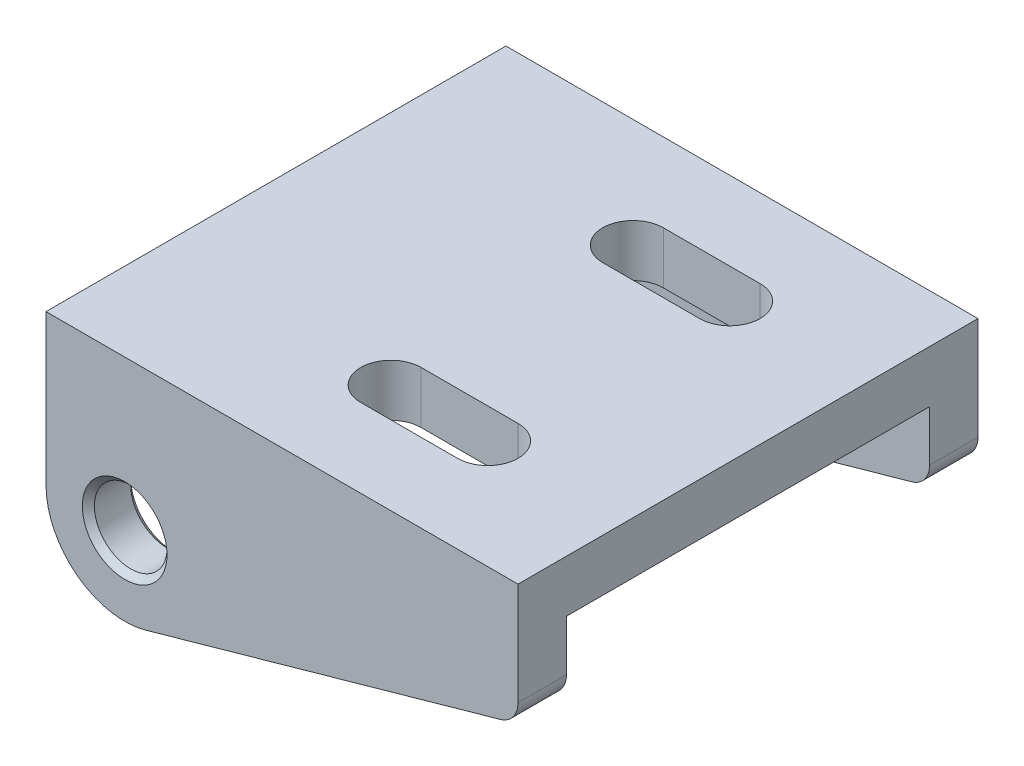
ISO-10303-21;
HEADER;
FILE_DESCRIPTION(('STEP AP214'),'2;1');
FILE_NAME('part.step','',(''),(''),'','','');
FILE_SCHEMA(('AUTOMOTIVE_DESIGN { 1 0 10303 214 1 1 1 1 }'));
ENDSEC;
DATA;
#1=APPLICATION_CONTEXT('core data for automotive mechanical design processes');
#2=APPLICATION_PROTOCOL_DEFINITION('international standard','automotive_design',2000,#1);
#3=PRODUCT_CONTEXT('',#1,'mechanical');
#4=PRODUCT('Part','Part','',(#3));
#5=PRODUCT_RELATED_PRODUCT_CATEGORY('part','',(#4));
#6=PRODUCT_DEFINITION_FORMATION('','',#4);
#7=PRODUCT_DEFINITION_CONTEXT('part definition',#1,'design');
#8=PRODUCT_DEFINITION('design','',#6,#7);
#9=PRODUCT_DEFINITION_SHAPE('','',#8);
#10=(LENGTH_UNIT() NAMED_UNIT(*) SI_UNIT(.MILLI.,.METRE.));
#11=(NAMED_UNIT(*) PLANE_ANGLE_UNIT() SI_UNIT($,.RADIAN.));
#12=(NAMED_UNIT(*) SI_UNIT($,.STERADIAN.) SOLID_ANGLE_UNIT());
#13=UNCERTAINTY_MEASURE_WITH_UNIT(LENGTH_MEASURE(1.E-05),#10,'distance_accuracy_value','');
#14=(GEOMETRIC_REPRESENTATION_CONTEXT(3) GLOBAL_UNCERTAINTY_ASSIGNED_CONTEXT((#13)) GLOBAL_UNIT_ASSIGNED_CONTEXT((#10,
#11,#12)) REPRESENTATION_CONTEXT('',''));
#15=CARTESIAN_POINT('',(0.,0.,0.));
#16=DIRECTION('',(0.,0.,1.));
#17=DIRECTION('',(1.,0.,0.));
#18=AXIS2_PLACEMENT_3D('',#15,#16,#17);
#19=CARTESIAN_POINT('',(0.,-21.,-19.));
#20=DIRECTION('',(0.271460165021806,-0.962449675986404,0.));
#21=DIRECTION('',(0.962449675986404,0.271460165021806,0.));
#22=AXIS2_PLACEMENT_3D('',#19,#20,#21);
#23=PLANE('',#22);
#24=DIRECTION('',(0.962449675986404,0.271460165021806,0.));
#25=VECTOR('',#24,1.);
#26=CARTESIAN_POINT('',(40.490146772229,-9.57970219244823,15.));
#27=LINE('',#26,#25);
#28=CARTESIAN_POINT('',(8.26449107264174,-18.66898969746,15.));
#29=VERTEX_POINT('',#28);
#30=CARTESIAN_POINT('',(37.5429203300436,-10.4109711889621,15.));
#31=VERTEX_POINT('',#30);
#32=EDGE_CURVE('E250',#29,#31,#27,.T.);
#33=ORIENTED_EDGE('',*,*,#32,.T.);
#34=DIRECTION('',(0.,0.,1.));
#35=VECTOR('',#34,1.);
#36=CARTESIAN_POINT('',(37.5429203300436,-10.4109711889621,-19.));
#37=LINE('',#36,#35);
#38=CARTESIAN_POINT('',(37.5429203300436,-10.4109711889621,19.));
#39=VERTEX_POINT('',#38);
#40=EDGE_CURVE('E313',#31,#39,#37,.T.);
#41=ORIENTED_EDGE('',*,*,#40,.T.);
#42=DIRECTION('',(0.962449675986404,0.271460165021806,0.));
#43=VECTOR('',#42,1.);
#44=CARTESIAN_POINT('',(0.,-21.,19.));
#45=LINE('',#44,#43);
#46=CARTESIAN_POINT('',(8.26449107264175,-18.66898969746,19.));
#47=VERTEX_POINT('',#46);
#48=EDGE_CURVE('E277',#47,#39,#45,.T.);
#49=ORIENTED_EDGE('',*,*,#48,.F.);
#50=DIRECTION('',(0.,0.,1.));
#51=VECTOR('',#50,1.);
#52=CARTESIAN_POINT('',(8.26449107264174,-18.66898969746,-19.));
#53=LINE('',#52,#51);
#54=EDGE_CURVE('E308',#47,#29,#53,.F.);
#55=ORIENTED_EDGE('',*,*,#54,.T.);
#56=EDGE_LOOP('',(#33,#41,#49,#55));
#57=FACE_BOUND('',#56,.T.);
#58=ADVANCED_FACE('F34',(#57),#23,.T.);
#59=CARTESIAN_POINT('',(6.5,-12.4130668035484,-19.));
#60=DIRECTION('',(0.,0.,1.));
#61=DIRECTION('',(1.,0.,0.));
#62=AXIS2_PLACEMENT_3D('',#59,#60,#61);
#63=CYLINDRICAL_SURFACE('',#62,6.5);
#64=CARTESIAN_POINT('',(6.5,-12.4130668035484,15.));
#65=DIRECTION('',(0.,0.,1.));
#66=DIRECTION('',(0.,-1.,0.));
#67=AXIS2_PLACEMENT_3D('',#64,#65,#66);
#68=CIRCLE('',#67,6.5);
#69=CARTESIAN_POINT('',(0.,-12.4130668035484,15.));
#70=VERTEX_POINT('',#69);
#71=EDGE_CURVE('E238',#70,#29,#68,.T.);
#72=ORIENTED_EDGE('',*,*,#71,.T.);
#73=ORIENTED_EDGE('',*,*,#54,.F.);
#74=CARTESIAN_POINT('',(6.5,-12.4130668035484,19.));
#75=DIRECTION('',(0.,0.,1.));
#76=DIRECTION('',(1.,0.,0.));
#77=AXIS2_PLACEMENT_3D('',#74,#75,#76);
#78=CIRCLE('',#77,6.5);
#79=CARTESIAN_POINT('',(0.,-12.4130668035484,19.));
#80=VERTEX_POINT('',#79);
#81=EDGE_CURVE('E305',#80,#47,#78,.T.);
#82=ORIENTED_EDGE('',*,*,#81,.F.);
#83=DIRECTION('',(0.,0.,1.));
#84=VECTOR('',#83,1.);
#85=CARTESIAN_POINT('',(0.,-12.4130668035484,-19.));
#86=LINE('',#85,#84);
#87=EDGE_CURVE('E299',#70,#80,#86,.T.);
#88=ORIENTED_EDGE('',*,*,#87,.F.);
#89=EDGE_LOOP('',(#72,#73,#82,#88));
#90=FACE_BOUND('',#89,.T.);
#91=ADVANCED_FACE('F398',(#90),#63,.T.);
#92=CARTESIAN_POINT('',(37.,-8.48607183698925,-19.));
#93=DIRECTION('',(0.,0.,1.));
#94=DIRECTION('',(1.,0.,0.));
#95=AXIS2_PLACEMENT_3D('',#92,#93,#94);
#96=CYLINDRICAL_SURFACE('',#95,2.);
#97=CARTESIAN_POINT('',(37.,-8.48607183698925,15.));
#98=DIRECTION('',(0.,0.,1.));
#99=DIRECTION('',(0.,-1.,0.));
#100=AXIS2_PLACEMENT_3D('',#97,#98,#99);
#101=CIRCLE('',#100,2.);
#102=CARTESIAN_POINT('',(39.,-8.48607183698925,15.));
#103=VERTEX_POINT('',#102);
#104=EDGE_CURVE('E247',#31,#103,#101,.T.);
#105=ORIENTED_EDGE('',*,*,#104,.T.);
#106=DIRECTION('',(0.,0.,1.));
#107=VECTOR('',#106,1.);
#108=CARTESIAN_POINT('',(39.,-8.48607183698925,-19.));
#109=LINE('',#108,#107);
#110=CARTESIAN_POINT('',(39.,-8.48607183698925,19.));
#111=VERTEX_POINT('',#110);
#112=EDGE_CURVE('E320',#111,#103,#109,.F.);
#113=ORIENTED_EDGE('',*,*,#112,.F.);
#114=CARTESIAN_POINT('',(37.,-8.48607183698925,19.));
#115=DIRECTION('',(0.,0.,1.));
#116=DIRECTION('',(1.,0.,0.));
#117=AXIS2_PLACEMENT_3D('',#114,#115,#116);
#118=CIRCLE('',#117,2.);
#119=EDGE_CURVE('E317',#39,#111,#118,.T.);
#120=ORIENTED_EDGE('',*,*,#119,.F.);
#121=ORIENTED_EDGE('',*,*,#40,.F.);
#122=EDGE_LOOP('',(#105,#113,#120,#121));
#123=FACE_BOUND('',#122,.T.);
#124=ADVANCED_FACE('F406',(#123),#96,.T.);
#125=CARTESIAN_POINT('',(0.,0.,-19.));
#126=DIRECTION('',(-1.,0.,0.));
#127=DIRECTION('',(0.,-1.,0.));
#128=AXIS2_PLACEMENT_3D('',#125,#126,#127);
#129=PLANE('',#128);
#130=DIRECTION('',(0.,1.,0.));
#131=VECTOR('',#130,1.);
#132=CARTESIAN_POINT('',(0.,-4.3,15.));
#133=LINE('',#132,#131);
#134=CARTESIAN_POINT('',(0.,-4.3,15.));
#135=VERTEX_POINT('',#134);
#136=EDGE_CURVE('E253',#70,#135,#133,.T.);
#137=ORIENTED_EDGE('',*,*,#136,.F.);
#138=ORIENTED_EDGE('',*,*,#87,.T.);
#139=DIRECTION('',(0.,-1.,0.));
#140=VECTOR('',#139,1.);
#141=CARTESIAN_POINT('',(0.,0.,19.));
#142=LINE('',#141,#140);
#143=CARTESIAN_POINT('',(0.,0.,19.));
#144=VERTEX_POINT('',#143);
#145=EDGE_CURVE('E274',#144,#80,#142,.T.);
#146=ORIENTED_EDGE('',*,*,#145,.F.);
#147=DIRECTION('',(0.,0.,1.));
#148=VECTOR('',#147,1.);
#149=CARTESIAN_POINT('',(0.,0.,-19.));
#150=LINE('',#149,#148);
#151=CARTESIAN_POINT('',(0.,0.,-19.));
#152=VERTEX_POINT('',#151);
#153=EDGE_CURVE('E297',#152,#144,#150,.T.);
#154=ORIENTED_EDGE('',*,*,#153,.F.);
#155=DIRECTION('',(0.,-1.,0.));
#156=VECTOR('',#155,1.);
#157=CARTESIAN_POINT('',(0.,0.,-19.));
#158=LINE('',#157,#156);
#159=CARTESIAN_POINT('',(0.,-12.4130668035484,-19.));
#160=VERTEX_POINT('',#159);
#161=EDGE_CURVE('E285',#152,#160,#158,.T.);
#162=ORIENTED_EDGE('',*,*,#161,.T.);
#163=CARTESIAN_POINT('',(0.,-12.4130668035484,-15.));
#164=VERTEX_POINT('',#163);
#165=EDGE_CURVE('E302',#160,#164,#86,.T.);
#166=ORIENTED_EDGE('',*,*,#165,.T.);
#167=DIRECTION('',(0.,-1.,0.));
#168=VECTOR('',#167,1.);
#169=CARTESIAN_POINT('',(0.,-4.3,-15.));
#170=LINE('',#169,#168);
#171=CARTESIAN_POINT('',(0.,-4.3,-15.));
#172=VERTEX_POINT('',#171);
#173=EDGE_CURVE('E259',#172,#164,#170,.T.);
#174=ORIENTED_EDGE('',*,*,#173,.F.);
#175=DIRECTION('',(0.,0.,-1.));
#176=VECTOR('',#175,1.);
#177=CARTESIAN_POINT('',(0.,-4.3,-15.));
#178=LINE('',#177,#176);
#179=EDGE_CURVE('E256',#135,#172,#178,.T.);
#180=ORIENTED_EDGE('',*,*,#179,.F.);
#181=EDGE_LOOP('',(#137,#138,#146,#154,#162,#166,#174,#180));
#182=FACE_BOUND('',#181,.T.);
#183=ADVANCED_FACE('F379',(#182),#129,.T.);
#184=CARTESIAN_POINT('',(0.,0.,-19.));
#185=DIRECTION('',(0.,1.,0.));
#186=DIRECTION('',(0.,0.,1.));
#187=AXIS2_PLACEMENT_3D('',#184,#185,#186);
#188=PLANE('',#187);
#189=CARTESIAN_POINT('',(19.5,0.,-10.));
#190=DIRECTION('',(0.,1.,0.));
#191=DIRECTION('',(0.,0.,1.));
#192=AXIS2_PLACEMENT_3D('',#189,#190,#191);
#193=CIRCLE('',#192,2.5);
#194=CARTESIAN_POINT('',(19.5,0.,-12.5));
#195=VERTEX_POINT('',#194);
#196=CARTESIAN_POINT('',(19.5,0.,-7.5));
#197=VERTEX_POINT('',#196);
#198=EDGE_CURVE('E204',#195,#197,#193,.T.);
#199=ORIENTED_EDGE('',*,*,#198,.F.);
#200=DIRECTION('',(-1.,0.,0.));
#201=VECTOR('',#200,1.);
#202=CARTESIAN_POINT('',(0.,0.,-12.5));
#203=LINE('',#202,#201);
#204=CARTESIAN_POINT('',(27.5,0.,-12.5));
#205=VERTEX_POINT('',#204);
#206=EDGE_CURVE('E197',#205,#195,#203,.T.);
#207=ORIENTED_EDGE('',*,*,#206,.F.);
#208=CARTESIAN_POINT('',(27.5,0.,-10.));
#209=DIRECTION('',(0.,1.,0.));
#210=DIRECTION('',(0.,0.,1.));
#211=AXIS2_PLACEMENT_3D('',#208,#209,#210);
#212=CIRCLE('',#211,2.5);
#213=CARTESIAN_POINT('',(27.5,0.,-7.5));
#214=VERTEX_POINT('',#213);
#215=EDGE_CURVE('E177',#214,#205,#212,.T.);
#216=ORIENTED_EDGE('',*,*,#215,.F.);
#217=DIRECTION('',(1.,0.,0.));
#218=VECTOR('',#217,1.);
#219=CARTESIAN_POINT('',(0.,0.,-7.5));
#220=LINE('',#219,#218);
#221=EDGE_CURVE('E202',#197,#214,#220,.T.);
#222=ORIENTED_EDGE('',*,*,#221,.F.);
#223=EDGE_LOOP('',(#199,#207,#216,#222));
#224=FACE_BOUND('',#223,.T.);
#225=CARTESIAN_POINT('',(19.5,0.,10.));
#226=DIRECTION('',(0.,1.,0.));
#227=DIRECTION('',(0.,0.,1.));
#228=AXIS2_PLACEMENT_3D('',#225,#226,#227);
#229=CIRCLE('',#228,2.5);
#230=CARTESIAN_POINT('',(19.5,0.,7.5));
#231=VERTEX_POINT('',#230);
#232=CARTESIAN_POINT('',(19.5,0.,12.5));
#233=VERTEX_POINT('',#232);
#234=EDGE_CURVE('E233',#231,#233,#229,.T.);
#235=ORIENTED_EDGE('',*,*,#234,.F.);
#236=DIRECTION('',(-1.,0.,0.));
#237=VECTOR('',#236,1.);
#238=CARTESIAN_POINT('',(0.,0.,7.5));
#239=LINE('',#238,#237);
#240=CARTESIAN_POINT('',(27.5,0.,7.50000000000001));
#241=VERTEX_POINT('',#240);
#242=EDGE_CURVE('E220',#241,#231,#239,.T.);
#243=ORIENTED_EDGE('',*,*,#242,.F.);
#244=CARTESIAN_POINT('',(27.5,0.,10.));
#245=DIRECTION('',(0.,1.,0.));
#246=DIRECTION('',(0.,0.,1.));
#247=AXIS2_PLACEMENT_3D('',#244,#245,#246);
#248=CIRCLE('',#247,2.5);
#249=CARTESIAN_POINT('',(27.5,0.,12.5));
#250=VERTEX_POINT('',#249);
#251=EDGE_CURVE('E228',#250,#241,#248,.T.);
#252=ORIENTED_EDGE('',*,*,#251,.F.);
#253=DIRECTION('',(1.,0.,0.));
#254=VECTOR('',#253,1.);
#255=CARTESIAN_POINT('',(0.,0.,12.5));
#256=LINE('',#255,#254);
#257=EDGE_CURVE('E231',#233,#250,#256,.T.);
#258=ORIENTED_EDGE('',*,*,#257,.F.);
#259=EDGE_LOOP('',(#235,#243,#252,#258));
#260=FACE_BOUND('',#259,.T.);
#261=ORIENTED_EDGE('',*,*,#153,.T.);
#262=DIRECTION('',(-1.,0.,0.));
#263=VECTOR('',#262,1.);
#264=CARTESIAN_POINT('',(0.,0.,19.));
#265=LINE('',#264,#263);
#266=CARTESIAN_POINT('',(39.,0.,19.));
#267=VERTEX_POINT('',#266);
#268=EDGE_CURVE('E282',#267,#144,#265,.T.);
#269=ORIENTED_EDGE('',*,*,#268,.F.);
#270=DIRECTION('',(0.,0.,1.));
#271=VECTOR('',#270,1.);
#272=CARTESIAN_POINT('',(39.,0.,-19.));
#273=LINE('',#272,#271);
#274=CARTESIAN_POINT('',(39.,0.,-19.));
#275=VERTEX_POINT('',#274);
#276=EDGE_CURVE('E296',#275,#267,#273,.T.);
#277=ORIENTED_EDGE('',*,*,#276,.F.);
#278=DIRECTION('',(-1.,0.,0.));
#279=VECTOR('',#278,1.);
#280=CARTESIAN_POINT('',(0.,0.,-19.));
#281=LINE('',#280,#279);
#282=EDGE_CURVE('E293',#275,#152,#281,.T.);
#283=ORIENTED_EDGE('',*,*,#282,.T.);
#284=EDGE_LOOP('',(#261,#269,#277,#283));
#285=FACE_BOUND('',#284,.T.);
#286=ADVANCED_FACE('F385',(#224,#260,#285),#188,.T.);
#287=CARTESIAN_POINT('',(39.,0.,-19.));
#288=DIRECTION('',(1.,0.,0.));
#289=DIRECTION('',(0.,0.,-1.));
#290=AXIS2_PLACEMENT_3D('',#287,#288,#289);
#291=PLANE('',#290);
#292=DIRECTION('',(0.,1.,0.));
#293=VECTOR('',#292,1.);
#294=CARTESIAN_POINT('',(39.,-4.29999999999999,15.));
#295=LINE('',#294,#293);
#296=CARTESIAN_POINT('',(39.,-4.29999999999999,15.));
#297=VERTEX_POINT('',#296);
#298=EDGE_CURVE('E244',#103,#297,#295,.T.);
#299=ORIENTED_EDGE('',*,*,#298,.T.);
#300=DIRECTION('',(0.,0.,-1.));
#301=VECTOR('',#300,1.);
#302=CARTESIAN_POINT('',(39.,-4.29999999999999,-15.));
#303=LINE('',#302,#301);
#304=CARTESIAN_POINT('',(39.,-4.29999999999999,-15.));
#305=VERTEX_POINT('',#304);
#306=EDGE_CURVE('E264',#297,#305,#303,.T.);
#307=ORIENTED_EDGE('',*,*,#306,.T.);
#308=DIRECTION('',(0.,-1.,0.));
#309=VECTOR('',#308,1.);
#310=CARTESIAN_POINT('',(39.,-4.29999999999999,-15.));
#311=LINE('',#310,#309);
#312=CARTESIAN_POINT('',(39.,-8.48607183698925,-15.));
#313=VERTEX_POINT('',#312);
#314=EDGE_CURVE('E241',#305,#313,#311,.T.);
#315=ORIENTED_EDGE('',*,*,#314,.T.);
#316=CARTESIAN_POINT('',(39.,-8.48607183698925,-19.));
#317=VERTEX_POINT('',#316);
#318=EDGE_CURVE('E319',#313,#317,#109,.F.);
#319=ORIENTED_EDGE('',*,*,#318,.T.);
#320=DIRECTION('',(0.,1.,0.));
#321=VECTOR('',#320,1.);
#322=CARTESIAN_POINT('',(39.,0.,-19.));
#323=LINE('',#322,#321);
#324=EDGE_CURVE('E291',#317,#275,#323,.T.);
#325=ORIENTED_EDGE('',*,*,#324,.T.);
#326=ORIENTED_EDGE('',*,*,#276,.T.);
#327=DIRECTION('',(0.,1.,0.));
#328=VECTOR('',#327,1.);
#329=CARTESIAN_POINT('',(39.,0.,19.));
#330=LINE('',#329,#328);
#331=EDGE_CURVE('E280',#111,#267,#330,.T.);
#332=ORIENTED_EDGE('',*,*,#331,.F.);
#333=ORIENTED_EDGE('',*,*,#112,.T.);
#334=EDGE_LOOP('',(#299,#307,#315,#319,#325,#326,#332,#333));
#335=FACE_BOUND('',#334,.T.);
#336=ADVANCED_FACE('F389',(#335),#291,.T.);
#337=DIRECTION('',(-0.962449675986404,-0.271460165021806,0.));
#338=VECTOR('',#337,1.);
#339=CARTESIAN_POINT('',(40.490146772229,-9.57970219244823,-15.));
#340=LINE('',#339,#338);
#341=CARTESIAN_POINT('',(37.5429203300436,-10.4109711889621,-15.));
#342=VERTEX_POINT('',#341);
#343=CARTESIAN_POINT('',(8.26449107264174,-18.66898969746,-15.));
#344=VERTEX_POINT('',#343);
#345=EDGE_CURVE('E271',#342,#344,#340,.T.);
#346=ORIENTED_EDGE('',*,*,#345,.T.);
#347=CARTESIAN_POINT('',(8.26449107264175,-18.66898969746,-19.));
#348=VERTEX_POINT('',#347);
#349=EDGE_CURVE('E307',#344,#348,#53,.F.);
#350=ORIENTED_EDGE('',*,*,#349,.T.);
#351=DIRECTION('',(0.962449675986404,0.271460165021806,0.));
#352=VECTOR('',#351,1.);
#353=CARTESIAN_POINT('',(0.,-21.,-19.));
#354=LINE('',#353,#352);
#355=CARTESIAN_POINT('',(37.5429203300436,-10.4109711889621,-19.));
#356=VERTEX_POINT('',#355);
#357=EDGE_CURVE('E288',#348,#356,#354,.T.);
#358=ORIENTED_EDGE('',*,*,#357,.T.);
#359=EDGE_CURVE('E314',#356,#342,#37,.T.);
#360=ORIENTED_EDGE('',*,*,#359,.T.);
#361=EDGE_LOOP('',(#346,#350,#358,#360));
#362=FACE_BOUND('',#361,.T.);
#363=ADVANCED_FACE('F366',(#362),#23,.T.);
#364=CARTESIAN_POINT('',(0.,0.,-19.));
#365=DIRECTION('',(0.,0.,1.));
#366=DIRECTION('',(1.,0.,0.));
#367=AXIS2_PLACEMENT_3D('',#364,#365,#366);
#368=PLANE('',#367);
#369=CARTESIAN_POINT('',(6.5,-12.4130668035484,-19.));
#370=DIRECTION('',(0.,0.,1.));
#371=DIRECTION('',(1.,0.,0.));
#372=AXIS2_PLACEMENT_3D('',#369,#370,#371);
#373=CIRCLE('',#372,3.50000000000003);
#374=CARTESIAN_POINT('',(10.,-12.4130668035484,-19.));
#375=VERTEX_POINT('',#374);
#376=EDGE_CURVE('E12',#375,#375,#373,.T.);
#377=ORIENTED_EDGE('',*,*,#376,.T.);
#378=EDGE_LOOP('',(#377));
#379=FACE_BOUND('',#378,.T.);
#380=ORIENTED_EDGE('',*,*,#324,.F.);
#381=CARTESIAN_POINT('',(37.,-8.48607183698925,-19.));
#382=DIRECTION('',(0.,0.,1.));
#383=DIRECTION('',(1.,0.,0.));
#384=AXIS2_PLACEMENT_3D('',#381,#382,#383);
#385=CIRCLE('',#384,2.);
#386=EDGE_CURVE('E323',#317,#356,#385,.F.);
#387=ORIENTED_EDGE('',*,*,#386,.T.);
#388=ORIENTED_EDGE('',*,*,#357,.F.);
#389=CARTESIAN_POINT('',(6.5,-12.4130668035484,-19.));
#390=DIRECTION('',(0.,0.,1.));
#391=DIRECTION('',(1.,0.,0.));
#392=AXIS2_PLACEMENT_3D('',#389,#390,#391);
#393=CIRCLE('',#392,6.5);
#394=EDGE_CURVE('E311',#348,#160,#393,.F.);
#395=ORIENTED_EDGE('',*,*,#394,.T.);
#396=ORIENTED_EDGE('',*,*,#161,.F.);
#397=ORIENTED_EDGE('',*,*,#282,.F.);
#398=EDGE_LOOP('',(#380,#387,#388,#395,#396,#397));
#399=FACE_BOUND('',#398,.T.);
#400=ADVANCED_FACE('F371',(#379,#399),#368,.F.);
#401=CARTESIAN_POINT('',(0.,0.,19.));
#402=DIRECTION('',(0.,0.,1.));
#403=DIRECTION('',(1.,0.,0.));
#404=AXIS2_PLACEMENT_3D('',#401,#402,#403);
#405=PLANE('',#404);
#406=CARTESIAN_POINT('',(6.5,-12.4130668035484,19.));
#407=DIRECTION('',(0.,0.,1.));
#408=DIRECTION('',(1.,0.,0.));
#409=AXIS2_PLACEMENT_3D('',#406,#407,#408);
#410=CIRCLE('',#409,3.49999999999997);
#411=CARTESIAN_POINT('',(9.99999999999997,-12.4130668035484,19.));
#412=VERTEX_POINT('',#411);
#413=EDGE_CURVE('E334',#412,#412,#410,.F.);
#414=ORIENTED_EDGE('',*,*,#413,.T.);
#415=EDGE_LOOP('',(#414));
#416=FACE_BOUND('',#415,.T.);
#417=ORIENTED_EDGE('',*,*,#48,.T.);
#418=ORIENTED_EDGE('',*,*,#119,.T.);
#419=ORIENTED_EDGE('',*,*,#331,.T.);
#420=ORIENTED_EDGE('',*,*,#268,.T.);
#421=ORIENTED_EDGE('',*,*,#145,.T.);
#422=ORIENTED_EDGE('',*,*,#81,.T.);
#423=EDGE_LOOP('',(#417,#418,#419,#420,#421,#422));
#424=FACE_BOUND('',#423,.T.);
#425=ADVANCED_FACE('F402',(#416,#424),#405,.T.);
#426=CARTESIAN_POINT('',(6.5,-12.4130668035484,-15.));
#427=DIRECTION('',(0.,0.,-1.));
#428=DIRECTION('',(0.,1.,0.));
#429=AXIS2_PLACEMENT_3D('',#426,#427,#428);
#430=CIRCLE('',#429,6.5);
#431=EDGE_CURVE('E235',#344,#164,#430,.T.);
#432=ORIENTED_EDGE('',*,*,#431,.T.);
#433=ORIENTED_EDGE('',*,*,#165,.F.);
#434=ORIENTED_EDGE('',*,*,#394,.F.);
#435=ORIENTED_EDGE('',*,*,#349,.F.);
#436=EDGE_LOOP('',(#432,#433,#434,#435));
#437=FACE_BOUND('',#436,.T.);
#438=ADVANCED_FACE('F375',(#437),#63,.T.);
#439=CARTESIAN_POINT('',(37.,-8.48607183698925,-15.));
#440=DIRECTION('',(0.,0.,-1.));
#441=DIRECTION('',(0.,1.,0.));
#442=AXIS2_PLACEMENT_3D('',#439,#440,#441);
#443=CIRCLE('',#442,2.);
#444=EDGE_CURVE('E268',#313,#342,#443,.T.);
#445=ORIENTED_EDGE('',*,*,#444,.T.);
#446=ORIENTED_EDGE('',*,*,#359,.F.);
#447=ORIENTED_EDGE('',*,*,#386,.F.);
#448=ORIENTED_EDGE('',*,*,#318,.F.);
#449=EDGE_LOOP('',(#445,#446,#447,#448));
#450=FACE_BOUND('',#449,.T.);
#451=ADVANCED_FACE('F364',(#450),#96,.T.);
#452=CARTESIAN_POINT('',(39.001,-4.29999999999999,15.));
#453=DIRECTION('',(0.,0.,1.));
#454=DIRECTION('',(0.,-1.,0.));
#455=AXIS2_PLACEMENT_3D('',#452,#453,#454);
#456=PLANE('',#455);
#457=CARTESIAN_POINT('',(6.5,-12.4130668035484,15.));
#458=DIRECTION('',(0.,0.,1.));
#459=DIRECTION('',(0.,-1.,0.));
#460=AXIS2_PLACEMENT_3D('',#457,#458,#459);
#461=CIRCLE('',#460,3.49999999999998);
#462=CARTESIAN_POINT('',(6.5,-15.9130668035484,15.));
#463=VERTEX_POINT('',#462);
#464=EDGE_CURVE('E325',#463,#463,#461,.T.);
#465=ORIENTED_EDGE('',*,*,#464,.T.);
#466=EDGE_LOOP('',(#465));
#467=FACE_BOUND('',#466,.T.);
#468=ORIENTED_EDGE('',*,*,#136,.T.);
#469=DIRECTION('',(-1.,0.,0.));
#470=VECTOR('',#469,1.);
#471=CARTESIAN_POINT('',(39.001,-4.29999999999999,15.));
#472=LINE('',#471,#470);
#473=EDGE_CURVE('E261',#297,#135,#472,.T.);
#474=ORIENTED_EDGE('',*,*,#473,.F.);
#475=ORIENTED_EDGE('',*,*,#298,.F.);
#476=ORIENTED_EDGE('',*,*,#104,.F.);
#477=ORIENTED_EDGE('',*,*,#32,.F.);
#478=ORIENTED_EDGE('',*,*,#71,.F.);
#479=EDGE_LOOP('',(#468,#474,#475,#476,#477,#478));
#480=FACE_BOUND('',#479,.T.);
#481=ADVANCED_FACE('F357',(#467,#480),#456,.F.);
#482=CARTESIAN_POINT('',(39.001,-4.29999999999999,-15.));
#483=DIRECTION('',(0.,0.,-1.));
#484=DIRECTION('',(0.,1.,0.));
#485=AXIS2_PLACEMENT_3D('',#482,#483,#484);
#486=PLANE('',#485);
#487=CARTESIAN_POINT('',(6.5,-12.4130668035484,-15.));
#488=DIRECTION('',(0.,0.,-1.));
#489=DIRECTION('',(0.,1.,0.));
#490=AXIS2_PLACEMENT_3D('',#487,#488,#489);
#491=CIRCLE('',#490,3.49999999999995);
#492=CARTESIAN_POINT('',(6.5,-8.91306680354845,-15.));
#493=VERTEX_POINT('',#492);
#494=EDGE_CURVE('E337',#493,#493,#491,.T.);
#495=ORIENTED_EDGE('',*,*,#494,.T.);
#496=EDGE_LOOP('',(#495));
#497=FACE_BOUND('',#496,.T.);
#498=ORIENTED_EDGE('',*,*,#345,.F.);
#499=ORIENTED_EDGE('',*,*,#444,.F.);
#500=ORIENTED_EDGE('',*,*,#314,.F.);
#501=DIRECTION('',(-1.,0.,0.));
#502=VECTOR('',#501,1.);
#503=CARTESIAN_POINT('',(39.001,-4.29999999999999,-15.));
#504=LINE('',#503,#502);
#505=EDGE_CURVE('E262',#305,#172,#504,.T.);
#506=ORIENTED_EDGE('',*,*,#505,.T.);
#507=ORIENTED_EDGE('',*,*,#173,.T.);
#508=ORIENTED_EDGE('',*,*,#431,.F.);
#509=EDGE_LOOP('',(#498,#499,#500,#506,#507,#508));
#510=FACE_BOUND('',#509,.T.);
#511=ADVANCED_FACE('F354',(#497,#510),#486,.F.);
#512=CARTESIAN_POINT('',(39.001,-4.29999999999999,-15.));
#513=DIRECTION('',(0.,1.,0.));
#514=DIRECTION('',(-1.,0.,0.));
#515=AXIS2_PLACEMENT_3D('',#512,#513,#514);
#516=PLANE('',#515);
#517=DIRECTION('',(1.,0.,0.));
#518=VECTOR('',#517,1.);
#519=CARTESIAN_POINT('',(19.5,-4.3,-12.5));
#520=LINE('',#519,#518);
#521=CARTESIAN_POINT('',(19.5,-4.3,-12.5));
#522=VERTEX_POINT('',#521);
#523=CARTESIAN_POINT('',(27.5,-4.3,-12.5));
#524=VERTEX_POINT('',#523);
#525=EDGE_CURVE('E183',#522,#524,#520,.T.);
#526=ORIENTED_EDGE('',*,*,#525,.F.);
#527=CARTESIAN_POINT('',(19.5,-4.3,-10.));
#528=DIRECTION('',(0.,-1.,0.));
#529=DIRECTION('',(-1.,0.,0.));
#530=AXIS2_PLACEMENT_3D('',#527,#528,#529);
#531=CIRCLE('',#530,2.5);
#532=CARTESIAN_POINT('',(19.5,-4.3,-7.5));
#533=VERTEX_POINT('',#532);
#534=EDGE_CURVE('E57',#533,#522,#531,.T.);
#535=ORIENTED_EDGE('',*,*,#534,.F.);
#536=DIRECTION('',(-1.,0.,0.));
#537=VECTOR('',#536,1.);
#538=CARTESIAN_POINT('',(19.5,-4.3,-7.5));
#539=LINE('',#538,#537);
#540=CARTESIAN_POINT('',(27.5,-4.3,-7.5));
#541=VERTEX_POINT('',#540);
#542=EDGE_CURVE('E190',#541,#533,#539,.T.);
#543=ORIENTED_EDGE('',*,*,#542,.F.);
#544=CARTESIAN_POINT('',(27.5,-4.3,-10.));
#545=DIRECTION('',(0.,-1.,0.));
#546=DIRECTION('',(-1.,0.,0.));
#547=AXIS2_PLACEMENT_3D('',#544,#545,#546);
#548=CIRCLE('',#547,2.5);
#549=EDGE_CURVE('E174',#524,#541,#548,.T.);
#550=ORIENTED_EDGE('',*,*,#549,.F.);
#551=EDGE_LOOP('',(#526,#535,#543,#550));
#552=FACE_BOUND('',#551,.T.);
#553=DIRECTION('',(1.,0.,0.));
#554=VECTOR('',#553,1.);
#555=CARTESIAN_POINT('',(19.5,-4.3,7.5));
#556=LINE('',#555,#554);
#557=CARTESIAN_POINT('',(19.5,-4.3,7.5));
#558=VERTEX_POINT('',#557);
#559=CARTESIAN_POINT('',(27.5,-4.3,7.5));
#560=VERTEX_POINT('',#559);
#561=EDGE_CURVE('E208',#558,#560,#556,.T.);
#562=ORIENTED_EDGE('',*,*,#561,.F.);
#563=CARTESIAN_POINT('',(19.5,-4.3,10.));
#564=DIRECTION('',(0.,-1.,0.));
#565=DIRECTION('',(1.,0.,0.));
#566=AXIS2_PLACEMENT_3D('',#563,#564,#565);
#567=CIRCLE('',#566,2.5);
#568=CARTESIAN_POINT('',(19.5,-4.3,12.5));
#569=VERTEX_POINT('',#568);
#570=EDGE_CURVE('E206',#569,#558,#567,.T.);
#571=ORIENTED_EDGE('',*,*,#570,.F.);
#572=DIRECTION('',(-1.,0.,0.));
#573=VECTOR('',#572,1.);
#574=CARTESIAN_POINT('',(19.5,-4.3,12.5));
#575=LINE('',#574,#573);
#576=CARTESIAN_POINT('',(27.5,-4.3,12.5));
#577=VERTEX_POINT('',#576);
#578=EDGE_CURVE('E214',#577,#569,#575,.T.);
#579=ORIENTED_EDGE('',*,*,#578,.F.);
#580=CARTESIAN_POINT('',(27.5,-4.3,10.));
#581=DIRECTION('',(0.,-1.,0.));
#582=DIRECTION('',(1.,0.,0.));
#583=AXIS2_PLACEMENT_3D('',#580,#581,#582);
#584=CIRCLE('',#583,2.5);
#585=EDGE_CURVE('E211',#560,#577,#584,.T.);
#586=ORIENTED_EDGE('',*,*,#585,.F.);
#587=EDGE_LOOP('',(#562,#571,#579,#586));
#588=FACE_BOUND('',#587,.T.);
#589=ORIENTED_EDGE('',*,*,#473,.T.);
#590=ORIENTED_EDGE('',*,*,#179,.T.);
#591=ORIENTED_EDGE('',*,*,#505,.F.);
#592=ORIENTED_EDGE('',*,*,#306,.F.);
#593=EDGE_LOOP('',(#589,#590,#591,#592));
#594=FACE_BOUND('',#593,.T.);
#595=ADVANCED_FACE('F187',(#552,#588,#594),#516,.F.);
#596=CARTESIAN_POINT('',(6.5,-12.4130668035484,27.4852813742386));
#597=DIRECTION('',(0.,0.,-1.));
#598=DIRECTION('',(-1.,0.,0.));
#599=AXIS2_PLACEMENT_3D('',#596,#597,#598);
#600=CYLINDRICAL_SURFACE('',#599,3.);
#601=CARTESIAN_POINT('',(6.5,-12.4130668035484,-15.4999999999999));
#602=DIRECTION('',(0.,0.,-1.));
#603=DIRECTION('',(-1.,0.,0.));
#604=AXIS2_PLACEMENT_3D('',#601,#602,#603);
#605=CIRCLE('',#604,3.);
#606=CARTESIAN_POINT('',(3.5,-12.4130668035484,-15.4999999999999));
#607=VERTEX_POINT('',#606);
#608=EDGE_CURVE('E42',#607,#607,#605,.F.);
#609=CARTESIAN_POINT('',(6.5,-12.4130668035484,-18.5));
#610=DIRECTION('',(0.,0.,1.));
#611=DIRECTION('',(1.,0.,0.));
#612=AXIS2_PLACEMENT_3D('',#609,#610,#611);
#613=CIRCLE('',#612,3.);
#614=CARTESIAN_POINT('',(3.5,-12.4130668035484,-18.5));
#615=VERTEX_POINT('',#614);
#616=EDGE_CURVE('E340',#615,#615,#613,.F.);
#617=CARTESIAN_POINT('',(3.5,-12.4130668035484,-15.4999999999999));
#618=CARTESIAN_POINT('',(3.5,-12.4130668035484,-15.5312499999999));
#619=CARTESIAN_POINT('',(3.5,-12.4130668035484,-15.5624999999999));
#620=CARTESIAN_POINT('',(3.5,-12.4130668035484,-15.6249999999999));
#621=CARTESIAN_POINT('',(3.5,-12.4130668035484,-15.6562499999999));
#622=CARTESIAN_POINT('',(3.5,-12.4130668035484,-15.7187499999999));
#623=CARTESIAN_POINT('',(3.5,-12.4130668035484,-15.7499999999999));
#624=CARTESIAN_POINT('',(3.5,-12.4130668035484,-15.8124999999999));
#625=CARTESIAN_POINT('',(3.5,-12.4130668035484,-15.8437499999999));
#626=CARTESIAN_POINT('',(3.5,-12.4130668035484,-15.9062499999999));
#627=CARTESIAN_POINT('',(3.5,-12.4130668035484,-15.9374999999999));
#628=CARTESIAN_POINT('',(3.5,-12.4130668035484,-15.9999999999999));
#629=CARTESIAN_POINT('',(3.5,-12.4130668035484,-16.0312499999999));
#630=CARTESIAN_POINT('',(3.5,-12.4130668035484,-16.0937499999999));
#631=CARTESIAN_POINT('',(3.5,-12.4130668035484,-16.1249999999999));
#632=CARTESIAN_POINT('',(3.5,-12.4130668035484,-16.1874999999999));
#633=CARTESIAN_POINT('',(3.5,-12.4130668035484,-16.21875));
#634=CARTESIAN_POINT('',(3.5,-12.4130668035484,-16.28125));
#635=CARTESIAN_POINT('',(3.5,-12.4130668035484,-16.3125));
#636=CARTESIAN_POINT('',(3.5,-12.4130668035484,-16.375));
#637=CARTESIAN_POINT('',(3.5,-12.4130668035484,-16.40625));
#638=CARTESIAN_POINT('',(3.5,-12.4130668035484,-16.46875));
#639=CARTESIAN_POINT('',(3.5,-12.4130668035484,-16.5));
#640=CARTESIAN_POINT('',(3.5,-12.4130668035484,-16.5625));
#641=CARTESIAN_POINT('',(3.5,-12.4130668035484,-16.59375));
#642=CARTESIAN_POINT('',(3.5,-12.4130668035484,-16.65625));
#643=CARTESIAN_POINT('',(3.5,-12.4130668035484,-16.6875));
#644=CARTESIAN_POINT('',(3.5,-12.4130668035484,-16.75));
#645=CARTESIAN_POINT('',(3.5,-12.4130668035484,-16.78125));
#646=CARTESIAN_POINT('',(3.5,-12.4130668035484,-16.84375));
#647=CARTESIAN_POINT('',(3.5,-12.4130668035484,-16.875));
#648=CARTESIAN_POINT('',(3.5,-12.4130668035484,-16.9375));
#649=CARTESIAN_POINT('',(3.5,-12.4130668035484,-16.96875));
#650=CARTESIAN_POINT('',(3.5,-12.4130668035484,-17.03125));
#651=CARTESIAN_POINT('',(3.5,-12.4130668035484,-17.0625));
#652=CARTESIAN_POINT('',(3.5,-12.4130668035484,-17.125));
#653=CARTESIAN_POINT('',(3.5,-12.4130668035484,-17.15625));
#654=CARTESIAN_POINT('',(3.5,-12.4130668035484,-17.21875));
#655=CARTESIAN_POINT('',(3.5,-12.4130668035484,-17.25));
#656=CARTESIAN_POINT('',(3.5,-12.4130668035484,-17.3125));
#657=CARTESIAN_POINT('',(3.5,-12.4130668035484,-17.34375));
#658=CARTESIAN_POINT('',(3.5,-12.4130668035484,-17.40625));
#659=CARTESIAN_POINT('',(3.5,-12.4130668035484,-17.4375));
#660=CARTESIAN_POINT('',(3.5,-12.4130668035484,-17.5));
#661=CARTESIAN_POINT('',(3.5,-12.4130668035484,-17.53125));
#662=CARTESIAN_POINT('',(3.5,-12.4130668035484,-17.59375));
#663=CARTESIAN_POINT('',(3.5,-12.4130668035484,-17.625));
#664=CARTESIAN_POINT('',(3.5,-12.4130668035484,-17.6875));
#665=CARTESIAN_POINT('',(3.5,-12.4130668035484,-17.71875));
#666=CARTESIAN_POINT('',(3.5,-12.4130668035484,-17.78125));
#667=CARTESIAN_POINT('',(3.5,-12.4130668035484,-17.8125));
#668=CARTESIAN_POINT('',(3.5,-12.4130668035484,-17.875));
#669=CARTESIAN_POINT('',(3.5,-12.4130668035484,-17.90625));
#670=CARTESIAN_POINT('',(3.5,-12.4130668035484,-17.96875));
#671=CARTESIAN_POINT('',(3.5,-12.4130668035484,-18.));
#672=CARTESIAN_POINT('',(3.5,-12.4130668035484,-18.0625));
#673=CARTESIAN_POINT('',(3.5,-12.4130668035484,-18.09375));
#674=CARTESIAN_POINT('',(3.5,-12.4130668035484,-18.15625));
#675=CARTESIAN_POINT('',(3.5,-12.4130668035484,-18.1875));
#676=CARTESIAN_POINT('',(3.5,-12.4130668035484,-18.25));
#677=CARTESIAN_POINT('',(3.5,-12.4130668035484,-18.28125));
#678=CARTESIAN_POINT('',(3.5,-12.4130668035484,-18.34375));
#679=CARTESIAN_POINT('',(3.5,-12.4130668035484,-18.375));
#680=CARTESIAN_POINT('',(3.5,-12.4130668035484,-18.4375));
#681=CARTESIAN_POINT('',(3.5,-12.4130668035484,-18.46875));
#682=CARTESIAN_POINT('',(3.5,-12.4130668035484,-18.5));
#683=B_SPLINE_CURVE_WITH_KNOTS('',3,(#617,#618,#619,#620,#621,#622,#623,#624,#625,#626,#627,
#628,#629,#630,#631,#632,#633,#634,#635,#636,#637,#638,#639,#640,#641,#642,#643,#644,#645,#646,
#647,#648,#649,#650,#651,#652,#653,#654,#655,#656,#657,#658,#659,#660,#661,#662,#663,#664,#665,
#666,#667,#668,#669,#670,#671,#672,#673,#674,#675,#676,#677,#678,#679,#680,#681,#682),
.UNSPECIFIED.,.F.,.F.,(4,2,2,2,2,2,2,2,2,2,2,2,2,2,2,2,2,2,2,2,2,2,2,2,2,2,2,2,2,2,2,2,4),(0.,
0.0937500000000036,0.1875,0.281250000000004,0.375,0.468750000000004,0.562500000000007,
0.656250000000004,0.750000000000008,0.843750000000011,0.937500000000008,1.03125000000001,
1.12500000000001,1.21875000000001,1.31250000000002,1.40625000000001,1.50000000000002,
1.59375000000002,1.68750000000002,1.78125000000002,1.87500000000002,1.96875000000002,
2.06250000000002,2.15625000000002,2.25000000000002,2.34375000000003,2.43750000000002,
2.53125000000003,2.62500000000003,2.71875000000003,2.81250000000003,2.90625000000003,
3.00000000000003),.UNSPECIFIED.);
#684=EDGE_CURVE('BSEAM345',#607,#615,#683,.T.);
#685=ORIENTED_EDGE('',*,*,#608,.T.);
#686=ORIENTED_EDGE('',*,*,#616,.T.);
#687=ORIENTED_EDGE('',*,*,#684,.T.);
#688=ORIENTED_EDGE('',*,*,#684,.F.);
#689=EDGE_LOOP('',(#685,#687,#686,#688));
#690=FACE_BOUND('',#689,.T.);
#691=ADVANCED_FACE('F345',(#690),#600,.F.);
#692=CARTESIAN_POINT('',(6.5,-12.4130668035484,15.5));
#693=DIRECTION('',(0.,0.,1.));
#694=DIRECTION('',(1.,0.,0.));
#695=AXIS2_PLACEMENT_3D('',#692,#693,#694);
#696=CIRCLE('',#695,3.);
#697=CARTESIAN_POINT('',(3.5,-12.4130668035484,15.5));
#698=VERTEX_POINT('',#697);
#699=EDGE_CURVE('E331',#698,#698,#696,.F.);
#700=CARTESIAN_POINT('',(6.5,-12.4130668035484,18.5));
#701=DIRECTION('',(0.,0.,1.));
#702=DIRECTION('',(1.,0.,0.));
#703=AXIS2_PLACEMENT_3D('',#700,#701,#702);
#704=CIRCLE('',#703,3.);
#705=CARTESIAN_POINT('',(3.5,-12.4130668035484,18.5));
#706=VERTEX_POINT('',#705);
#707=EDGE_CURVE('E328',#706,#706,#704,.T.);
#708=CARTESIAN_POINT('',(3.5,-12.4130668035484,15.5));
#709=CARTESIAN_POINT('',(3.5,-12.4130668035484,15.53125));
#710=CARTESIAN_POINT('',(3.5,-12.4130668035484,15.5625));
#711=CARTESIAN_POINT('',(3.5,-12.4130668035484,15.625));
#712=CARTESIAN_POINT('',(3.5,-12.4130668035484,15.65625));
#713=CARTESIAN_POINT('',(3.5,-12.4130668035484,15.71875));
#714=CARTESIAN_POINT('',(3.5,-12.4130668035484,15.75));
#715=CARTESIAN_POINT('',(3.5,-12.4130668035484,15.8125));
#716=CARTESIAN_POINT('',(3.5,-12.4130668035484,15.84375));
#717=CARTESIAN_POINT('',(3.5,-12.4130668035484,15.90625));
#718=CARTESIAN_POINT('',(3.5,-12.4130668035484,15.9375));
#719=CARTESIAN_POINT('',(3.5,-12.4130668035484,16.));
#720=CARTESIAN_POINT('',(3.5,-12.4130668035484,16.03125));
#721=CARTESIAN_POINT('',(3.5,-12.4130668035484,16.09375));
#722=CARTESIAN_POINT('',(3.5,-12.4130668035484,16.125));
#723=CARTESIAN_POINT('',(3.5,-12.4130668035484,16.1875));
#724=CARTESIAN_POINT('',(3.5,-12.4130668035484,16.21875));
#725=CARTESIAN_POINT('',(3.5,-12.4130668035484,16.28125));
#726=CARTESIAN_POINT('',(3.5,-12.4130668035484,16.3125));
#727=CARTESIAN_POINT('',(3.5,-12.4130668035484,16.375));
#728=CARTESIAN_POINT('',(3.5,-12.4130668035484,16.40625));
#729=CARTESIAN_POINT('',(3.5,-12.4130668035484,16.46875));
#730=CARTESIAN_POINT('',(3.5,-12.4130668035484,16.5));
#731=CARTESIAN_POINT('',(3.5,-12.4130668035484,16.5625));
#732=CARTESIAN_POINT('',(3.5,-12.4130668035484,16.59375));
#733=CARTESIAN_POINT('',(3.5,-12.4130668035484,16.65625));
#734=CARTESIAN_POINT('',(3.5,-12.4130668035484,16.6875));
#735=CARTESIAN_POINT('',(3.5,-12.4130668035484,16.75));
#736=CARTESIAN_POINT('',(3.5,-12.4130668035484,16.78125));
#737=CARTESIAN_POINT('',(3.5,-12.4130668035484,16.84375));
#738=CARTESIAN_POINT('',(3.5,-12.4130668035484,16.875));
#739=CARTESIAN_POINT('',(3.5,-12.4130668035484,16.9375));
#740=CARTESIAN_POINT('',(3.5,-12.4130668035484,16.96875));
#741=CARTESIAN_POINT('',(3.5,-12.4130668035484,17.03125));
#742=CARTESIAN_POINT('',(3.5,-12.4130668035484,17.0625));
#743=CARTESIAN_POINT('',(3.5,-12.4130668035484,17.125));
#744=CARTESIAN_POINT('',(3.5,-12.4130668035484,17.15625));
#745=CARTESIAN_POINT('',(3.5,-12.4130668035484,17.21875));
#746=CARTESIAN_POINT('',(3.5,-12.4130668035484,17.25));
#747=CARTESIAN_POINT('',(3.5,-12.4130668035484,17.3125));
#748=CARTESIAN_POINT('',(3.5,-12.4130668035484,17.34375));
#749=CARTESIAN_POINT('',(3.5,-12.4130668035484,17.40625));
#750=CARTESIAN_POINT('',(3.5,-12.4130668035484,17.4375));
#751=CARTESIAN_POINT('',(3.5,-12.4130668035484,17.5));
#752=CARTESIAN_POINT('',(3.5,-12.4130668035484,17.53125));
#753=CARTESIAN_POINT('',(3.5,-12.4130668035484,17.59375));
#754=CARTESIAN_POINT('',(3.5,-12.4130668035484,17.625));
#755=CARTESIAN_POINT('',(3.5,-12.4130668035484,17.6875));
#756=CARTESIAN_POINT('',(3.5,-12.4130668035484,17.71875));
#757=CARTESIAN_POINT('',(3.5,-12.4130668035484,17.78125));
#758=CARTESIAN_POINT('',(3.5,-12.4130668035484,17.8125));
#759=CARTESIAN_POINT('',(3.5,-12.4130668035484,17.875));
#760=CARTESIAN_POINT('',(3.5,-12.4130668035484,17.90625));
#761=CARTESIAN_POINT('',(3.5,-12.4130668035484,17.96875));
#762=CARTESIAN_POINT('',(3.5,-12.4130668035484,18.));
#763=CARTESIAN_POINT('',(3.5,-12.4130668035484,18.0625));
#764=CARTESIAN_POINT('',(3.5,-12.4130668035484,18.09375));
#765=CARTESIAN_POINT('',(3.5,-12.4130668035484,18.15625));
#766=CARTESIAN_POINT('',(3.5,-12.4130668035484,18.1875));
#767=CARTESIAN_POINT('',(3.5,-12.4130668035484,18.25));
#768=CARTESIAN_POINT('',(3.5,-12.4130668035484,18.28125));
#769=CARTESIAN_POINT('',(3.5,-12.4130668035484,18.34375));
#770=CARTESIAN_POINT('',(3.5,-12.4130668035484,18.375));
#771=CARTESIAN_POINT('',(3.5,-12.4130668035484,18.4375));
#772=CARTESIAN_POINT('',(3.5,-12.4130668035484,18.46875));
#773=CARTESIAN_POINT('',(3.5,-12.4130668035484,18.5));
#774=B_SPLINE_CURVE_WITH_KNOTS('',3,(#708,#709,#710,#711,#712,#713,#714,#715,#716,#717,#718,
#719,#720,#721,#722,#723,#724,#725,#726,#727,#728,#729,#730,#731,#732,#733,#734,#735,#736,#737,
#738,#739,#740,#741,#742,#743,#744,#745,#746,#747,#748,#749,#750,#751,#752,#753,#754,#755,#756,
#757,#758,#759,#760,#761,#762,#763,#764,#765,#766,#767,#768,#769,#770,#771,#772,#773),
.UNSPECIFIED.,.F.,.F.,(4,2,2,2,2,2,2,2,2,2,2,2,2,2,2,2,2,2,2,2,2,2,2,2,2,2,2,2,2,2,2,2,4),(0.,
0.0937500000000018,0.187500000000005,0.281250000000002,0.375000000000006,0.468750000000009,
0.562500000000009,0.656250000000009,0.750000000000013,0.843750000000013,0.937500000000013,
1.03125000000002,1.12500000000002,1.21875000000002,1.31250000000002,1.40625000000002,
1.50000000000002,1.59375000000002,1.68750000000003,1.78125000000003,1.87500000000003,
1.96875000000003,2.06250000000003,2.15625000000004,2.25000000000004,2.34375000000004,
2.43750000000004,2.53125000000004,2.62500000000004,2.71875000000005,2.81250000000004,
2.90625000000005,3.00000000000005),.UNSPECIFIED.);
#775=EDGE_CURVE('BSEAM439',#698,#706,#774,.T.);
#776=ORIENTED_EDGE('',*,*,#699,.T.);
#777=ORIENTED_EDGE('',*,*,#707,.T.);
#778=ORIENTED_EDGE('',*,*,#775,.T.);
#779=ORIENTED_EDGE('',*,*,#775,.F.);
#780=EDGE_LOOP('',(#776,#778,#777,#779));
#781=FACE_BOUND('',#780,.T.);
#782=ADVANCED_FACE('F439',(#781),#600,.F.);
#783=CARTESIAN_POINT('',(6.5,-12.4130668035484,15.));
#784=DIRECTION('',(0.,0.,-1.));
#785=DIRECTION('',(-1.,0.,0.));
#786=AXIS2_PLACEMENT_3D('',#783,#784,#785);
#787=CONICAL_SURFACE('',#786,3.49999999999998,0.785398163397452);
#788=ORIENTED_EDGE('',*,*,#699,.F.);
#789=EDGE_LOOP('',(#788));
#790=FACE_BOUND('',#789,.T.);
#791=ORIENTED_EDGE('',*,*,#464,.F.);
#792=EDGE_LOOP('',(#791));
#793=FACE_BOUND('',#792,.T.);
#794=ADVANCED_FACE('F442',(#790,#793),#787,.F.);
#795=CARTESIAN_POINT('',(6.5,-12.4130668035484,19.));
#796=DIRECTION('',(0.,0.,1.));
#797=DIRECTION('',(1.,0.,0.));
#798=AXIS2_PLACEMENT_3D('',#795,#796,#797);
#799=CONICAL_SURFACE('',#798,3.49999999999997,0.785398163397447);
#800=ORIENTED_EDGE('',*,*,#707,.F.);
#801=EDGE_LOOP('',(#800));
#802=FACE_BOUND('',#801,.T.);
#803=ORIENTED_EDGE('',*,*,#413,.F.);
#804=EDGE_LOOP('',(#803));
#805=FACE_BOUND('',#804,.T.);
#806=ADVANCED_FACE('F351',(#802,#805),#799,.F.);
#807=CARTESIAN_POINT('',(6.5,-12.4130668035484,-15.));
#808=DIRECTION('',(0.,0.,1.));
#809=DIRECTION('',(1.,0.,0.));
#810=AXIS2_PLACEMENT_3D('',#807,#808,#809);
#811=CONICAL_SURFACE('',#810,3.49999999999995,0.785398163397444);
#812=ORIENTED_EDGE('',*,*,#608,.F.);
#813=EDGE_LOOP('',(#812));
#814=FACE_BOUND('',#813,.T.);
#815=ORIENTED_EDGE('',*,*,#494,.F.);
#816=EDGE_LOOP('',(#815));
#817=FACE_BOUND('',#816,.T.);
#818=ADVANCED_FACE('F348',(#814,#817),#811,.F.);
#819=CARTESIAN_POINT('',(6.5,-12.4130668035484,-18.5));
#820=DIRECTION('',(0.,0.,-1.));
#821=DIRECTION('',(-1.,0.,0.));
#822=AXIS2_PLACEMENT_3D('',#819,#820,#821);
#823=CONICAL_SURFACE('',#822,3.,0.78539816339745);
#824=ORIENTED_EDGE('',*,*,#376,.F.);
#825=EDGE_LOOP('',(#824));
#826=FACE_BOUND('',#825,.T.);
#827=ORIENTED_EDGE('',*,*,#616,.F.);
#828=EDGE_LOOP('',(#827));
#829=FACE_BOUND('',#828,.T.);
#830=ADVANCED_FACE('F36',(#826,#829),#823,.F.);
#831=CARTESIAN_POINT('',(19.5,5.7,10.));
#832=DIRECTION('',(0.,-1.,0.));
#833=DIRECTION('',(1.,0.,0.));
#834=AXIS2_PLACEMENT_3D('',#831,#832,#833);
#835=CYLINDRICAL_SURFACE('',#834,2.5);
#836=ORIENTED_EDGE('',*,*,#234,.T.);
#837=DIRECTION('',(0.,-1.,0.));
#838=VECTOR('',#837,1.);
#839=CARTESIAN_POINT('',(19.5,5.7,12.5));
#840=LINE('',#839,#838);
#841=EDGE_CURVE('E218',#233,#569,#840,.T.);
#842=ORIENTED_EDGE('',*,*,#841,.T.);
#843=ORIENTED_EDGE('',*,*,#570,.T.);
#844=DIRECTION('',(0.,-1.,0.));
#845=VECTOR('',#844,1.);
#846=CARTESIAN_POINT('',(19.5,5.7,7.5));
#847=LINE('',#846,#845);
#848=EDGE_CURVE('E217',#231,#558,#847,.T.);
#849=ORIENTED_EDGE('',*,*,#848,.F.);
#850=EDGE_LOOP('',(#836,#842,#843,#849));
#851=FACE_BOUND('',#850,.T.);
#852=ADVANCED_FACE('F444',(#851),#835,.F.);
#853=CARTESIAN_POINT('',(19.5,5.7,12.5));
#854=DIRECTION('',(0.,0.,1.));
#855=DIRECTION('',(1.,0.,0.));
#856=AXIS2_PLACEMENT_3D('',#853,#854,#855);
#857=PLANE('',#856);
#858=ORIENTED_EDGE('',*,*,#257,.T.);
#859=DIRECTION('',(0.,-1.,0.));
#860=VECTOR('',#859,1.);
#861=CARTESIAN_POINT('',(27.5,5.7,12.5));
#862=LINE('',#861,#860);
#863=EDGE_CURVE('E221',#250,#577,#862,.T.);
#864=ORIENTED_EDGE('',*,*,#863,.T.);
#865=ORIENTED_EDGE('',*,*,#578,.T.);
#866=ORIENTED_EDGE('',*,*,#841,.F.);
#867=EDGE_LOOP('',(#858,#864,#865,#866));
#868=FACE_BOUND('',#867,.T.);
#869=ADVANCED_FACE('F447',(#868),#857,.F.);
#870=CARTESIAN_POINT('',(27.5,5.7,10.));
#871=DIRECTION('',(0.,-1.,0.));
#872=DIRECTION('',(1.,0.,0.));
#873=AXIS2_PLACEMENT_3D('',#870,#871,#872);
#874=CYLINDRICAL_SURFACE('',#873,2.5);
#875=ORIENTED_EDGE('',*,*,#251,.T.);
#876=DIRECTION('',(0.,-1.,0.));
#877=VECTOR('',#876,1.);
#878=CARTESIAN_POINT('',(27.5,5.7,7.5));
#879=LINE('',#878,#877);
#880=EDGE_CURVE('E223',#241,#560,#879,.T.);
#881=ORIENTED_EDGE('',*,*,#880,.T.);
#882=ORIENTED_EDGE('',*,*,#585,.T.);
#883=ORIENTED_EDGE('',*,*,#863,.F.);
#884=EDGE_LOOP('',(#875,#881,#882,#883));
#885=FACE_BOUND('',#884,.T.);
#886=ADVANCED_FACE('F453',(#885),#874,.F.);
#887=CARTESIAN_POINT('',(19.5,5.7,7.5));
#888=DIRECTION('',(0.,0.,-1.));
#889=DIRECTION('',(-1.,0.,0.));
#890=AXIS2_PLACEMENT_3D('',#887,#888,#889);
#891=PLANE('',#890);
#892=ORIENTED_EDGE('',*,*,#242,.T.);
#893=ORIENTED_EDGE('',*,*,#848,.T.);
#894=ORIENTED_EDGE('',*,*,#561,.T.);
#895=ORIENTED_EDGE('',*,*,#880,.F.);
#896=EDGE_LOOP('',(#892,#893,#894,#895));
#897=FACE_BOUND('',#896,.T.);
#898=ADVANCED_FACE('F449',(#897),#891,.F.);
#899=CARTESIAN_POINT('',(19.5,5.7,-10.));
#900=DIRECTION('',(0.,-1.,0.));
#901=DIRECTION('',(1.,0.,0.));
#902=AXIS2_PLACEMENT_3D('',#899,#900,#901);
#903=CYLINDRICAL_SURFACE('',#902,2.5);
#904=ORIENTED_EDGE('',*,*,#198,.T.);
#905=DIRECTION('',(0.,-1.,0.));
#906=VECTOR('',#905,1.);
#907=CARTESIAN_POINT('',(19.5,5.7,-7.5));
#908=LINE('',#907,#906);
#909=EDGE_CURVE('E195',#197,#533,#908,.T.);
#910=ORIENTED_EDGE('',*,*,#909,.T.);
#911=ORIENTED_EDGE('',*,*,#534,.T.);
#912=DIRECTION('',(0.,-1.,0.));
#913=VECTOR('',#912,1.);
#914=CARTESIAN_POINT('',(19.5,5.7,-12.5));
#915=LINE('',#914,#913);
#916=EDGE_CURVE('E180',#195,#522,#915,.T.);
#917=ORIENTED_EDGE('',*,*,#916,.F.);
#918=EDGE_LOOP('',(#904,#910,#911,#917));
#919=FACE_BOUND('',#918,.T.);
#920=ADVANCED_FACE('F452',(#919),#903,.F.);
#921=CARTESIAN_POINT('',(19.5,5.7,-7.5));
#922=DIRECTION('',(0.,0.,1.));
#923=DIRECTION('',(1.,0.,0.));
#924=AXIS2_PLACEMENT_3D('',#921,#922,#923);
#925=PLANE('',#924);
#926=ORIENTED_EDGE('',*,*,#221,.T.);
#927=DIRECTION('',(0.,-1.,0.));
#928=VECTOR('',#927,1.);
#929=CARTESIAN_POINT('',(27.5,5.7,-7.5));
#930=LINE('',#929,#928);
#931=EDGE_CURVE('E179',#214,#541,#930,.T.);
#932=ORIENTED_EDGE('',*,*,#931,.T.);
#933=ORIENTED_EDGE('',*,*,#542,.T.);
#934=ORIENTED_EDGE('',*,*,#909,.F.);
#935=EDGE_LOOP('',(#926,#932,#933,#934));
#936=FACE_BOUND('',#935,.T.);
#937=ADVANCED_FACE('F463',(#936),#925,.F.);
#938=CARTESIAN_POINT('',(27.5,5.7,-10.));
#939=DIRECTION('',(0.,-1.,0.));
#940=DIRECTION('',(1.,0.,0.));
#941=AXIS2_PLACEMENT_3D('',#938,#939,#940);
#942=CYLINDRICAL_SURFACE('',#941,2.5);
#943=ORIENTED_EDGE('',*,*,#215,.T.);
#944=DIRECTION('',(0.,-1.,0.));
#945=VECTOR('',#944,1.);
#946=CARTESIAN_POINT('',(27.5,5.7,-12.5));
#947=LINE('',#946,#945);
#948=EDGE_CURVE('E49',#205,#524,#947,.T.);
#949=ORIENTED_EDGE('',*,*,#948,.T.);
#950=ORIENTED_EDGE('',*,*,#549,.T.);
#951=ORIENTED_EDGE('',*,*,#931,.F.);
#952=EDGE_LOOP('',(#943,#949,#950,#951));
#953=FACE_BOUND('',#952,.T.);
#954=ADVANCED_FACE('F171',(#953),#942,.F.);
#955=CARTESIAN_POINT('',(19.5,5.7,-12.5));
#956=DIRECTION('',(0.,0.,-1.));
#957=DIRECTION('',(-1.,0.,0.));
#958=AXIS2_PLACEMENT_3D('',#955,#956,#957);
#959=PLANE('',#958);
#960=ORIENTED_EDGE('',*,*,#206,.T.);
#961=ORIENTED_EDGE('',*,*,#916,.T.);
#962=ORIENTED_EDGE('',*,*,#525,.T.);
#963=ORIENTED_EDGE('',*,*,#948,.F.);
#964=EDGE_LOOP('',(#960,#961,#962,#963));
#965=FACE_BOUND('',#964,.T.);
#966=ADVANCED_FACE('F184',(#965),#959,.F.);
#967=CLOSED_SHELL('',(#58,#91,#124,#183,#286,#336,#363,#400,#425,#438,#451,#481,#511,#595,#691,
#782,#794,#806,#818,#830,#852,#869,#886,#898,#920,#937,#954,#966));
#968=MANIFOLD_SOLID_BREP('B2',#967);
#969=ADVANCED_BREP_SHAPE_REPRESENTATION('',(#18,#968),#14);
#970=SHAPE_DEFINITION_REPRESENTATION(#9,#969);
ENDSEC;
END-ISO-10303-21;
